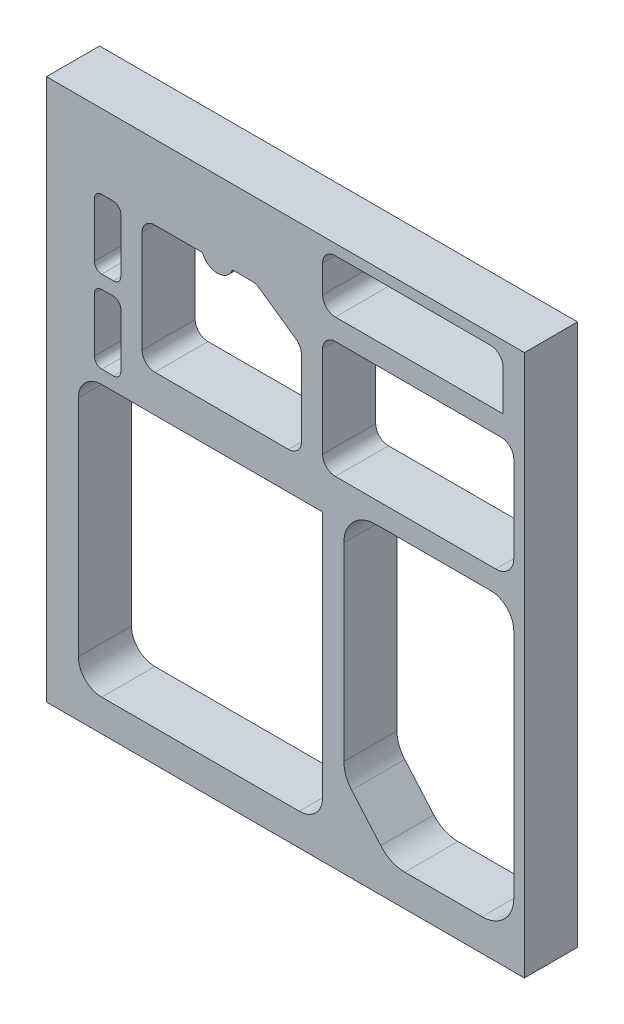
from build123d import *

# Parameters (mm, degrees)
SKETCH1_W           = 285.75
SKETCH1_H           = 323.85
BOSS_EXTRUDE1_DEPTH = 31.75


with BuildPart() as part:
    # Sketch1 → Boss-Extrude1 (new body)
    with BuildSketch(Plane.XY):
        with Locations((123.825, 142.875)):
            Rectangle(SKETCH1_W, SKETCH1_H)
        with BuildLine():
            Line((13.97, 0), (132.08, 0))
            ThreePointArc((132.08, 0), (141.958281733, 4.091718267), (146.05, 13.97))
            Line((146.05, 13.97), (146.05, 161.925))
            Line((146.05, 161.925), (13.97, 161.925))
            ThreePointArc((13.97, 161.925), (4.091718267, 157.833281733), (0, 147.955))
            Line((0, 147.955), (0, 13.97))
            ThreePointArc((0, 13.97), (4.091718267, 4.091718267), (13.97, 0))
        make_face(mode=Mode.SUBTRACT)
        with BuildLine():
            Line((246.38, 171.45), (177.8, 171.45))
            ThreePointArc((177.8, 171.45), (164.329615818, 165.870384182), (158.75, 152.4))
            Line((158.75, 152.4), (158.75, 39.059243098))
            ThreePointArc((158.75, 39.059243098), (159.954765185, 32.3921527), (163.416676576, 26.568346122))
            Line((163.416676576, 26.568346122), (180.793286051, 6.559103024))
            ThreePointArc((180.793286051, 6.559103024), (187.272467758, 1.717168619), (195.176609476, 0))
            Line((195.176609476, 0), (241.3, 0))
            ThreePointArc((241.3, 0), (254.770384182, 5.579615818), (260.35, 19.05))
            Line((260.35, 19.05), (260.35, 157.48))
            ThreePointArc((260.35, 157.48), (256.258281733, 167.358281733), (246.38, 171.45))
        make_face(mode=Mode.SUBTRACT)
        with BuildLine():
            Line((260.35, 194.945), (260.35, 246.38))
            ThreePointArc((260.35, 246.38), (258.118153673, 251.768153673), (252.73, 254))
            Line((252.73, 254), (153.67, 254))
            ThreePointArc((153.67, 254), (148.281846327, 251.768153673), (146.05, 246.38))
            Line((146.05, 246.38), (146.05, 191.77))
            ThreePointArc((146.05, 191.77), (148.281846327, 186.381846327), (153.67, 184.15))
            Line((153.67, 184.15), (249.555, 184.15))
            ThreePointArc((249.555, 184.15), (257.188217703, 187.311782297), (260.35, 194.945))
        make_face(mode=Mode.SUBTRACT)
        with BuildLine():
            Line((103.688719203, 260.35), (92.132877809, 260.35))
            ThreePointArc((92.132877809, 260.35), (83.185, 254.1143), (74.237122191, 260.35))
            Line((74.237122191, 260.35), (45.72, 260.35))
            ThreePointArc((45.72, 260.35), (40.331846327, 258.118153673), (38.1, 252.73))
            Line((38.1, 252.73), (38.1, 191.77))
            ThreePointArc((38.1, 191.77), (40.331846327, 186.381846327), (45.72, 184.15))
            Line((45.72, 184.15), (125.73, 184.15))
            ThreePointArc((125.73, 184.15), (131.118153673, 186.381846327), (133.35, 191.77))
            Line((133.35, 191.77), (133.35, 237.296529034))
            ThreePointArc((133.35, 237.296529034), (132.489022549, 240.815053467), (130.100652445, 243.538467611))
            Line((130.100652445, 243.538467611), (108.059371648, 258.971938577))
            ThreePointArc((108.059371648, 258.971938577), (105.980097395, 259.997323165), (103.688719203, 260.35))
        make_face(mode=Mode.SUBTRACT)
        with BuildLine():
            Line((25.4, 174.3075), (25.4, 206.6925))
            ThreePointArc((25.4, 206.6925), (24.098089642, 209.835589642), (20.955, 211.1375))
            Line((20.955, 211.1375), (13.97, 211.1375))
            ThreePointArc((13.97, 211.1375), (10.826910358, 209.835589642), (9.525, 206.6925))
            Line((9.525, 206.6925), (9.525, 174.3075))
            ThreePointArc((9.525, 174.3075), (10.826910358, 171.164410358), (13.97, 169.8625))
            Line((13.97, 169.8625), (20.955, 169.8625))
            ThreePointArc((20.955, 169.8625), (24.098089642, 171.164410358), (25.4, 174.3075))
        make_face(mode=Mode.SUBTRACT)
        with BuildLine():
            Line((25.4, 223.52), (25.4, 255.905))
            ThreePointArc((25.4, 255.905), (24.098089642, 259.048089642), (20.955, 260.35))
            Line((20.955, 260.35), (13.97, 260.35))
            ThreePointArc((13.97, 260.35), (10.826910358, 259.048089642), (9.525, 255.905))
            Line((9.525, 255.905), (9.525, 223.52))
            ThreePointArc((9.525, 223.52), (10.826910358, 220.376910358), (13.97, 219.075))
            Line((13.97, 219.075), (20.955, 219.075))
            ThreePointArc((20.955, 219.075), (24.098089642, 220.376910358), (25.4, 223.52))
        make_face(mode=Mode.SUBTRACT)
        with BuildLine():
            Line((254, 266.7), (254, 290.83))
            ThreePointArc((254, 290.83), (251.768153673, 296.218153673), (246.38, 298.45))
            Line((246.38, 298.45), (153.67, 298.45))
            ThreePointArc((153.67, 298.45), (148.281846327, 296.218153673), (146.05, 290.83))
            Line((146.05, 290.83), (146.05, 274.32))
            ThreePointArc((146.05, 274.32), (148.281846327, 268.931846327), (153.67, 266.7))
            Line((153.67, 266.7), (181.8005, 266.7))
            Line((181.8005, 266.7), (254, 266.7))
        make_face(mode=Mode.SUBTRACT)
    extrude(amount=BOSS_EXTRUDE1_DEPTH)


solid = part.part
